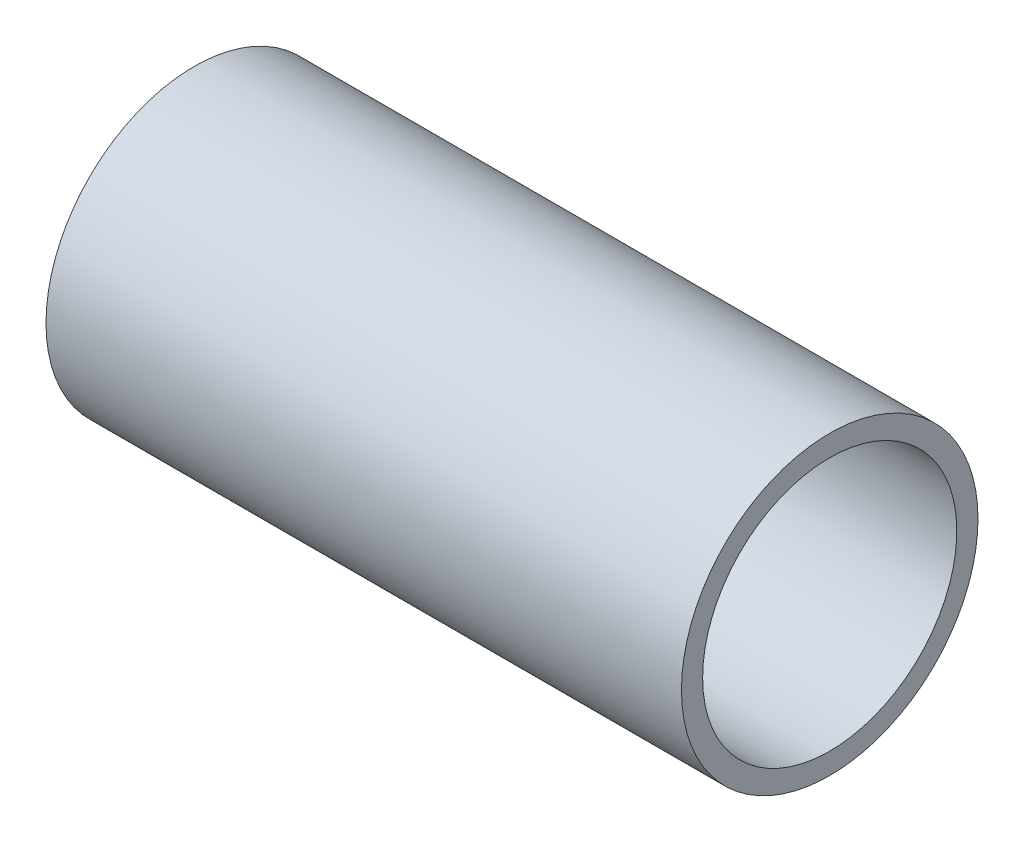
ISO-10303-21;
HEADER;
FILE_DESCRIPTION(('STEP AP214'),'2;1');
FILE_NAME('part.step','',(''),(''),'','','');
FILE_SCHEMA(('AUTOMOTIVE_DESIGN { 1 0 10303 214 1 1 1 1 }'));
ENDSEC;
DATA;
#1=APPLICATION_CONTEXT('core data for automotive mechanical design processes');
#2=APPLICATION_PROTOCOL_DEFINITION('international standard','automotive_design',2000,#1);
#3=PRODUCT_CONTEXT('',#1,'mechanical');
#4=PRODUCT('Part','Part','',(#3));
#5=PRODUCT_RELATED_PRODUCT_CATEGORY('part','',(#4));
#6=PRODUCT_DEFINITION_FORMATION('','',#4);
#7=PRODUCT_DEFINITION_CONTEXT('part definition',#1,'design');
#8=PRODUCT_DEFINITION('design','',#6,#7);
#9=PRODUCT_DEFINITION_SHAPE('','',#8);
#10=(LENGTH_UNIT() NAMED_UNIT(*) SI_UNIT(.MILLI.,.METRE.));
#11=(NAMED_UNIT(*) PLANE_ANGLE_UNIT() SI_UNIT($,.RADIAN.));
#12=(NAMED_UNIT(*) SI_UNIT($,.STERADIAN.) SOLID_ANGLE_UNIT());
#13=UNCERTAINTY_MEASURE_WITH_UNIT(LENGTH_MEASURE(1.E-05),#10,'distance_accuracy_value','');
#14=(GEOMETRIC_REPRESENTATION_CONTEXT(3) GLOBAL_UNCERTAINTY_ASSIGNED_CONTEXT((#13)) GLOBAL_UNIT_ASSIGNED_CONTEXT((#10,
#11,#12)) REPRESENTATION_CONTEXT('',''));
#15=CARTESIAN_POINT('',(0.,0.,0.));
#16=DIRECTION('',(0.,0.,1.));
#17=DIRECTION('',(1.,0.,0.));
#18=AXIS2_PLACEMENT_3D('',#15,#16,#17);
#19=CARTESIAN_POINT('',(34.7989898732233,380.,1.99999999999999));
#20=DIRECTION('',(-1.,0.,0.));
#21=DIRECTION('',(0.,0.,1.));
#22=AXIS2_PLACEMENT_3D('',#19,#20,#21);
#23=CYLINDRICAL_SURFACE('',#22,7.00000000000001);
#24=CARTESIAN_POINT('',(15.,380.,2.));
#25=DIRECTION('',(-1.,0.,0.));
#26=DIRECTION('',(0.,0.,1.));
#27=AXIS2_PLACEMENT_3D('',#24,#25,#26);
#28=CIRCLE('',#27,7.00000000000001);
#29=CARTESIAN_POINT('',(15.,380.,9.00000000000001));
#30=VERTEX_POINT('',#29);
#31=EDGE_CURVE('E10',#30,#30,#28,.F.);
#32=CARTESIAN_POINT('',(-15.,380.,2.));
#33=DIRECTION('',(-1.,0.,0.));
#34=DIRECTION('',(0.,0.,1.));
#35=AXIS2_PLACEMENT_3D('',#32,#33,#34);
#36=CIRCLE('',#35,7.00000000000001);
#37=CARTESIAN_POINT('',(-15.,380.,9.00000000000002));
#38=VERTEX_POINT('',#37);
#39=EDGE_CURVE('E44',#38,#38,#36,.T.);
#40=CARTESIAN_POINT('',(15.,380.,9.00000000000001));
#41=CARTESIAN_POINT('',(14.6875,380.,9.00000000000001));
#42=CARTESIAN_POINT('',(14.375,380.,9.00000000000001));
#43=CARTESIAN_POINT('',(13.75,380.,9.00000000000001));
#44=CARTESIAN_POINT('',(13.4375,380.,9.00000000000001));
#45=CARTESIAN_POINT('',(12.8125,380.,9.00000000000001));
#46=CARTESIAN_POINT('',(12.5,380.,9.00000000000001));
#47=CARTESIAN_POINT('',(11.875,380.,9.00000000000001));
#48=CARTESIAN_POINT('',(11.5625,380.,9.00000000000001));
#49=CARTESIAN_POINT('',(10.9375,380.,9.00000000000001));
#50=CARTESIAN_POINT('',(10.625,380.,9.00000000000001));
#51=CARTESIAN_POINT('',(10.,380.,9.00000000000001));
#52=CARTESIAN_POINT('',(9.6875,380.,9.00000000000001));
#53=CARTESIAN_POINT('',(9.0625,380.,9.00000000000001));
#54=CARTESIAN_POINT('',(8.75,380.,9.00000000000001));
#55=CARTESIAN_POINT('',(8.125,380.,9.00000000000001));
#56=CARTESIAN_POINT('',(7.8125,380.,9.00000000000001));
#57=CARTESIAN_POINT('',(7.1875,380.,9.00000000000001));
#58=CARTESIAN_POINT('',(6.875,380.,9.00000000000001));
#59=CARTESIAN_POINT('',(6.25,380.,9.00000000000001));
#60=CARTESIAN_POINT('',(5.9375,380.,9.00000000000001));
#61=CARTESIAN_POINT('',(5.3125,380.,9.00000000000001));
#62=CARTESIAN_POINT('',(5.,380.,9.00000000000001));
#63=CARTESIAN_POINT('',(4.375,380.,9.00000000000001));
#64=CARTESIAN_POINT('',(4.0625,380.,9.00000000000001));
#65=CARTESIAN_POINT('',(3.4375,380.,9.00000000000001));
#66=CARTESIAN_POINT('',(3.125,380.,9.00000000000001));
#67=CARTESIAN_POINT('',(2.5,380.,9.00000000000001));
#68=CARTESIAN_POINT('',(2.1875,380.,9.00000000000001));
#69=CARTESIAN_POINT('',(1.5625,380.,9.00000000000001));
#70=CARTESIAN_POINT('',(1.25000000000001,380.,9.00000000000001));
#71=CARTESIAN_POINT('',(0.625000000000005,380.,9.00000000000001));
#72=CARTESIAN_POINT('',(0.312500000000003,380.,9.00000000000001));
#73=CARTESIAN_POINT('',(-0.312499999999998,380.,9.00000000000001));
#74=CARTESIAN_POINT('',(-0.624999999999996,380.,9.00000000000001));
#75=CARTESIAN_POINT('',(-1.25,380.,9.00000000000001));
#76=CARTESIAN_POINT('',(-1.5625,380.,9.00000000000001));
#77=CARTESIAN_POINT('',(-2.1875,380.,9.00000000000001));
#78=CARTESIAN_POINT('',(-2.5,380.,9.00000000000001));
#79=CARTESIAN_POINT('',(-3.125,380.,9.00000000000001));
#80=CARTESIAN_POINT('',(-3.4375,380.,9.00000000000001));
#81=CARTESIAN_POINT('',(-4.0625,380.,9.00000000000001));
#82=CARTESIAN_POINT('',(-4.375,380.,9.00000000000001));
#83=CARTESIAN_POINT('',(-5.,380.,9.00000000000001));
#84=CARTESIAN_POINT('',(-5.3125,380.,9.00000000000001));
#85=CARTESIAN_POINT('',(-5.9375,380.,9.00000000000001));
#86=CARTESIAN_POINT('',(-6.25,380.,9.00000000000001));
#87=CARTESIAN_POINT('',(-6.875,380.,9.00000000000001));
#88=CARTESIAN_POINT('',(-7.1875,380.,9.00000000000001));
#89=CARTESIAN_POINT('',(-7.8125,380.,9.00000000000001));
#90=CARTESIAN_POINT('',(-8.125,380.,9.00000000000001));
#91=CARTESIAN_POINT('',(-8.75,380.,9.00000000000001));
#92=CARTESIAN_POINT('',(-9.0625,380.,9.00000000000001));
#93=CARTESIAN_POINT('',(-9.6875,380.,9.00000000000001));
#94=CARTESIAN_POINT('',(-10.,380.,9.00000000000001));
#95=CARTESIAN_POINT('',(-10.625,380.,9.00000000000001));
#96=CARTESIAN_POINT('',(-10.9375,380.,9.00000000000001));
#97=CARTESIAN_POINT('',(-11.5625,380.,9.00000000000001));
#98=CARTESIAN_POINT('',(-11.875,380.,9.00000000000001));
#99=CARTESIAN_POINT('',(-12.5,380.,9.00000000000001));
#100=CARTESIAN_POINT('',(-12.8125,380.,9.00000000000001));
#101=CARTESIAN_POINT('',(-13.4375,380.,9.00000000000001));
#102=CARTESIAN_POINT('',(-13.75,380.,9.00000000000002));
#103=CARTESIAN_POINT('',(-14.375,380.,9.00000000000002));
#104=CARTESIAN_POINT('',(-14.6875,380.,9.00000000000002));
#105=CARTESIAN_POINT('',(-15.,380.,9.00000000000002));
#106=B_SPLINE_CURVE_WITH_KNOTS('',3,(#40,#41,#42,#43,#44,#45,#46,#47,#48,#49,#50,#51,#52,#53,
#54,#55,#56,#57,#58,#59,#60,#61,#62,#63,#64,#65,#66,#67,#68,#69,#70,#71,#72,#73,#74,#75,#76,#77,
#78,#79,#80,#81,#82,#83,#84,#85,#86,#87,#88,#89,#90,#91,#92,#93,#94,#95,#96,#97,#98,#99,#100,
#101,#102,#103,#104,#105),.UNSPECIFIED.,.F.,.F.,(4,2,2,2,2,2,2,2,2,2,2,2,2,2,2,2,2,2,2,2,2,2,2,
2,2,2,2,2,2,2,2,2,4),(0.,0.937500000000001,1.875,2.8125,3.75,4.6875,5.625,6.5625,7.5,8.4375,
9.375,10.3125,11.25,12.1875,13.125,14.0625,15.,15.9375,16.875,17.8125,18.75,19.6875,20.625,
21.5625,22.5,23.4375,24.375,25.3125,26.25,27.1875,28.125,29.0625,30.),.UNSPECIFIED.);
#107=EDGE_CURVE('BSEAM33',#30,#38,#106,.T.);
#108=ORIENTED_EDGE('',*,*,#31,.F.);
#109=ORIENTED_EDGE('',*,*,#39,.F.);
#110=ORIENTED_EDGE('',*,*,#107,.T.);
#111=ORIENTED_EDGE('',*,*,#107,.F.);
#112=EDGE_LOOP('',(#108,#110,#109,#111));
#113=FACE_BOUND('',#112,.T.);
#114=ADVANCED_FACE('F33',(#113),#23,.T.);
#115=CARTESIAN_POINT('',(-15.,380.,2.));
#116=DIRECTION('',(-1.,0.,0.));
#117=DIRECTION('',(0.,0.,1.));
#118=AXIS2_PLACEMENT_3D('',#115,#116,#117);
#119=PLANE('',#118);
#120=CARTESIAN_POINT('',(-15.,380.,2.));
#121=DIRECTION('',(-1.,0.,0.));
#122=DIRECTION('',(0.,0.,1.));
#123=AXIS2_PLACEMENT_3D('',#120,#121,#122);
#124=CIRCLE('',#123,6.00000000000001);
#125=CARTESIAN_POINT('',(-15.,380.,8.00000000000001));
#126=VERTEX_POINT('',#125);
#127=EDGE_CURVE('E46',#126,#126,#124,.T.);
#128=ORIENTED_EDGE('',*,*,#127,.F.);
#129=EDGE_LOOP('',(#128));
#130=FACE_BOUND('',#129,.T.);
#131=ORIENTED_EDGE('',*,*,#39,.T.);
#132=EDGE_LOOP('',(#131));
#133=FACE_BOUND('',#132,.T.);
#134=ADVANCED_FACE('F51',(#130,#133),#119,.T.);
#135=CARTESIAN_POINT('',(34.7989898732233,380.,1.99999999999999));
#136=DIRECTION('',(-1.,0.,0.));
#137=DIRECTION('',(0.,0.,1.));
#138=AXIS2_PLACEMENT_3D('',#135,#136,#137);
#139=CYLINDRICAL_SURFACE('',#138,6.00000000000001);
#140=CARTESIAN_POINT('',(15.,380.,2.));
#141=DIRECTION('',(-1.,0.,0.));
#142=DIRECTION('',(0.,0.,1.));
#143=AXIS2_PLACEMENT_3D('',#140,#141,#142);
#144=CIRCLE('',#143,6.00000000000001);
#145=CARTESIAN_POINT('',(15.,380.,8.));
#146=VERTEX_POINT('',#145);
#147=EDGE_CURVE('E36',#146,#146,#144,.F.);
#148=CARTESIAN_POINT('',(15.,380.,8.));
#149=CARTESIAN_POINT('',(14.6875,380.,8.));
#150=CARTESIAN_POINT('',(14.375,380.,8.));
#151=CARTESIAN_POINT('',(13.75,380.,8.));
#152=CARTESIAN_POINT('',(13.4375,380.,8.));
#153=CARTESIAN_POINT('',(12.8125,380.,8.));
#154=CARTESIAN_POINT('',(12.5,380.,8.));
#155=CARTESIAN_POINT('',(11.875,380.,8.));
#156=CARTESIAN_POINT('',(11.5625,380.,8.));
#157=CARTESIAN_POINT('',(10.9375,380.,8.));
#158=CARTESIAN_POINT('',(10.625,380.,8.));
#159=CARTESIAN_POINT('',(10.,380.,8.));
#160=CARTESIAN_POINT('',(9.6875,380.,8.));
#161=CARTESIAN_POINT('',(9.0625,380.,8.));
#162=CARTESIAN_POINT('',(8.75,380.,8.00000000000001));
#163=CARTESIAN_POINT('',(8.125,380.,8.00000000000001));
#164=CARTESIAN_POINT('',(7.8125,380.,8.00000000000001));
#165=CARTESIAN_POINT('',(7.1875,380.,8.00000000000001));
#166=CARTESIAN_POINT('',(6.875,380.,8.00000000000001));
#167=CARTESIAN_POINT('',(6.25,380.,8.00000000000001));
#168=CARTESIAN_POINT('',(5.9375,380.,8.00000000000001));
#169=CARTESIAN_POINT('',(5.3125,380.,8.00000000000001));
#170=CARTESIAN_POINT('',(5.,380.,8.00000000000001));
#171=CARTESIAN_POINT('',(4.375,380.,8.00000000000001));
#172=CARTESIAN_POINT('',(4.0625,380.,8.00000000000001));
#173=CARTESIAN_POINT('',(3.4375,380.,8.00000000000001));
#174=CARTESIAN_POINT('',(3.125,380.,8.00000000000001));
#175=CARTESIAN_POINT('',(2.5,380.,8.00000000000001));
#176=CARTESIAN_POINT('',(2.1875,380.,8.00000000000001));
#177=CARTESIAN_POINT('',(1.5625,380.,8.00000000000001));
#178=CARTESIAN_POINT('',(1.25000000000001,380.,8.00000000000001));
#179=CARTESIAN_POINT('',(0.625000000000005,380.,8.00000000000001));
#180=CARTESIAN_POINT('',(0.312500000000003,380.,8.00000000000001));
#181=CARTESIAN_POINT('',(-0.312499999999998,380.,8.00000000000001));
#182=CARTESIAN_POINT('',(-0.624999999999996,380.,8.00000000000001));
#183=CARTESIAN_POINT('',(-1.25,380.,8.00000000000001));
#184=CARTESIAN_POINT('',(-1.5625,380.,8.00000000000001));
#185=CARTESIAN_POINT('',(-2.1875,380.,8.00000000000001));
#186=CARTESIAN_POINT('',(-2.5,380.,8.00000000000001));
#187=CARTESIAN_POINT('',(-3.125,380.,8.00000000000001));
#188=CARTESIAN_POINT('',(-3.4375,380.,8.00000000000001));
#189=CARTESIAN_POINT('',(-4.0625,380.,8.00000000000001));
#190=CARTESIAN_POINT('',(-4.375,380.,8.00000000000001));
#191=CARTESIAN_POINT('',(-5.,380.,8.00000000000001));
#192=CARTESIAN_POINT('',(-5.3125,380.,8.00000000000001));
#193=CARTESIAN_POINT('',(-5.9375,380.,8.00000000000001));
#194=CARTESIAN_POINT('',(-6.25,380.,8.00000000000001));
#195=CARTESIAN_POINT('',(-6.875,380.,8.00000000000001));
#196=CARTESIAN_POINT('',(-7.1875,380.,8.00000000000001));
#197=CARTESIAN_POINT('',(-7.8125,380.,8.00000000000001));
#198=CARTESIAN_POINT('',(-8.125,380.,8.00000000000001));
#199=CARTESIAN_POINT('',(-8.75,380.,8.00000000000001));
#200=CARTESIAN_POINT('',(-9.0625,380.,8.00000000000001));
#201=CARTESIAN_POINT('',(-9.6875,380.,8.00000000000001));
#202=CARTESIAN_POINT('',(-10.,380.,8.00000000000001));
#203=CARTESIAN_POINT('',(-10.625,380.,8.00000000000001));
#204=CARTESIAN_POINT('',(-10.9375,380.,8.00000000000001));
#205=CARTESIAN_POINT('',(-11.5625,380.,8.00000000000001));
#206=CARTESIAN_POINT('',(-11.875,380.,8.00000000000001));
#207=CARTESIAN_POINT('',(-12.5,380.,8.00000000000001));
#208=CARTESIAN_POINT('',(-12.8125,380.,8.00000000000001));
#209=CARTESIAN_POINT('',(-13.4375,380.,8.00000000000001));
#210=CARTESIAN_POINT('',(-13.75,380.,8.00000000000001));
#211=CARTESIAN_POINT('',(-14.375,380.,8.00000000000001));
#212=CARTESIAN_POINT('',(-14.6875,380.,8.00000000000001));
#213=CARTESIAN_POINT('',(-15.,380.,8.00000000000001));
#214=B_SPLINE_CURVE_WITH_KNOTS('',3,(#148,#149,#150,#151,#152,#153,#154,#155,#156,#157,#158,
#159,#160,#161,#162,#163,#164,#165,#166,#167,#168,#169,#170,#171,#172,#173,#174,#175,#176,#177,
#178,#179,#180,#181,#182,#183,#184,#185,#186,#187,#188,#189,#190,#191,#192,#193,#194,#195,#196,
#197,#198,#199,#200,#201,#202,#203,#204,#205,#206,#207,#208,#209,#210,#211,#212,#213),
.UNSPECIFIED.,.F.,.F.,(4,2,2,2,2,2,2,2,2,2,2,2,2,2,2,2,2,2,2,2,2,2,2,2,2,2,2,2,2,2,2,2,4),(0.,
0.937500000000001,1.875,2.8125,3.75,4.6875,5.625,6.5625,7.5,8.4375,9.375,10.3125,11.25,12.1875,
13.125,14.0625,15.,15.9375,16.875,17.8125,18.75,19.6875,20.625,21.5625,22.5,23.4375,24.375,
25.3125,26.25,27.1875,28.125,29.0625,30.),.UNSPECIFIED.);
#215=EDGE_CURVE('BSEAM58',#146,#126,#214,.T.);
#216=ORIENTED_EDGE('',*,*,#147,.T.);
#217=ORIENTED_EDGE('',*,*,#127,.T.);
#218=ORIENTED_EDGE('',*,*,#215,.T.);
#219=ORIENTED_EDGE('',*,*,#215,.F.);
#220=EDGE_LOOP('',(#216,#218,#217,#219));
#221=FACE_BOUND('',#220,.T.);
#222=ADVANCED_FACE('F58',(#221),#139,.F.);
#223=CARTESIAN_POINT('',(15.,395.,15.));
#224=DIRECTION('',(-1.,0.,0.));
#225=DIRECTION('',(0.,0.,1.));
#226=AXIS2_PLACEMENT_3D('',#223,#224,#225);
#227=PLANE('',#226);
#228=ORIENTED_EDGE('',*,*,#31,.T.);
#229=EDGE_LOOP('',(#228));
#230=FACE_BOUND('',#229,.T.);
#231=ORIENTED_EDGE('',*,*,#147,.F.);
#232=EDGE_LOOP('',(#231));
#233=FACE_BOUND('',#232,.T.);
#234=ADVANCED_FACE('F63',(#230,#233),#227,.F.);
#235=CLOSED_SHELL('',(#114,#134,#222,#234));
#236=MANIFOLD_SOLID_BREP('B2',#235);
#237=ADVANCED_BREP_SHAPE_REPRESENTATION('',(#18,#236),#14);
#238=SHAPE_DEFINITION_REPRESENTATION(#9,#237);
ENDSEC;
END-ISO-10303-21;
